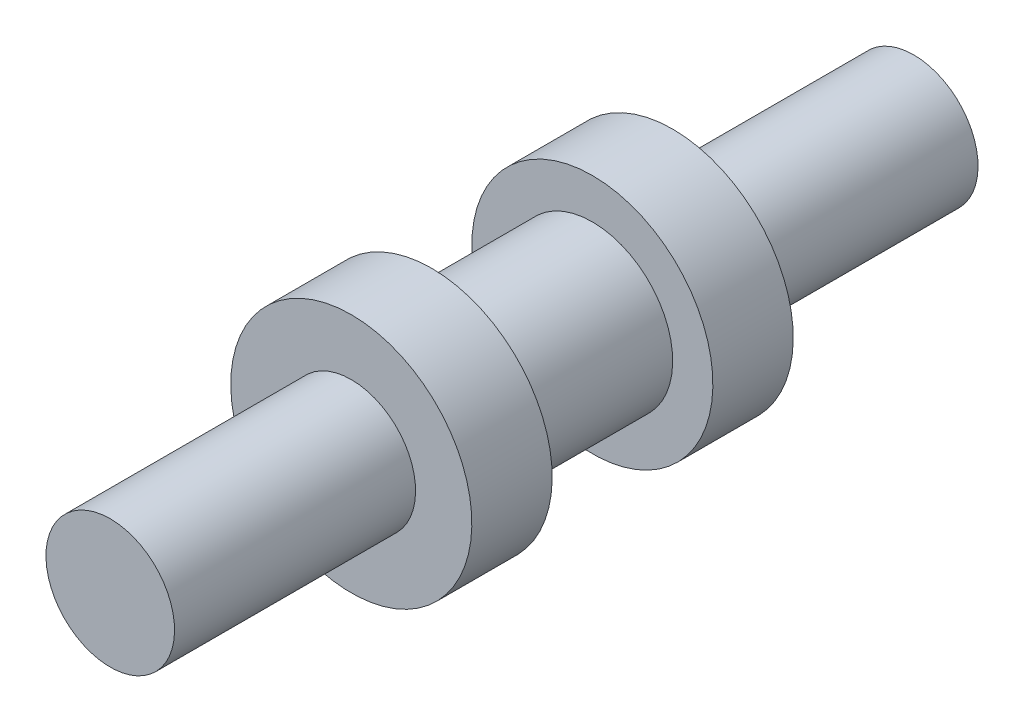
ISO-10303-21;
HEADER;
FILE_DESCRIPTION(('STEP AP214'),'2;1');
FILE_NAME('part.step','',(''),(''),'','','');
FILE_SCHEMA(('AUTOMOTIVE_DESIGN { 1 0 10303 214 1 1 1 1 }'));
ENDSEC;
DATA;
#1=APPLICATION_CONTEXT('core data for automotive mechanical design processes');
#2=APPLICATION_PROTOCOL_DEFINITION('international standard','automotive_design',2000,#1);
#3=PRODUCT_CONTEXT('',#1,'mechanical');
#4=PRODUCT('Part','Part','',(#3));
#5=PRODUCT_RELATED_PRODUCT_CATEGORY('part','',(#4));
#6=PRODUCT_DEFINITION_FORMATION('','',#4);
#7=PRODUCT_DEFINITION_CONTEXT('part definition',#1,'design');
#8=PRODUCT_DEFINITION('design','',#6,#7);
#9=PRODUCT_DEFINITION_SHAPE('','',#8);
#10=(LENGTH_UNIT() NAMED_UNIT(*) SI_UNIT(.MILLI.,.METRE.));
#11=(NAMED_UNIT(*) PLANE_ANGLE_UNIT() SI_UNIT($,.RADIAN.));
#12=(NAMED_UNIT(*) SI_UNIT($,.STERADIAN.) SOLID_ANGLE_UNIT());
#13=UNCERTAINTY_MEASURE_WITH_UNIT(LENGTH_MEASURE(1.E-05),#10,'distance_accuracy_value','');
#14=(GEOMETRIC_REPRESENTATION_CONTEXT(3) GLOBAL_UNCERTAINTY_ASSIGNED_CONTEXT((#13)) GLOBAL_UNIT_ASSIGNED_CONTEXT((#10,
#11,#12)) REPRESENTATION_CONTEXT('',''));
#15=CARTESIAN_POINT('',(0.,0.,0.));
#16=DIRECTION('',(0.,0.,1.));
#17=DIRECTION('',(1.,0.,0.));
#18=AXIS2_PLACEMENT_3D('',#15,#16,#17);
#19=CARTESIAN_POINT('',(0.,6.35,-6.35));
#20=DIRECTION('',(0.,0.,1.));
#21=DIRECTION('',(0.,-1.,0.));
#22=AXIS2_PLACEMENT_3D('',#19,#20,#21);
#23=PLANE('',#22);
#24=CARTESIAN_POINT('',(0.,0.,-6.35));
#25=DIRECTION('',(0.,0.,-1.));
#26=DIRECTION('',(0.,1.,0.));
#27=AXIS2_PLACEMENT_3D('',#24,#25,#26);
#28=CIRCLE('',#27,6.35);
#29=CARTESIAN_POINT('',(0.,6.35,-6.35));
#30=VERTEX_POINT('',#29);
#31=EDGE_CURVE('E10',#30,#30,#28,.T.);
#32=ORIENTED_EDGE('',*,*,#31,.T.);
#33=EDGE_LOOP('',(#32));
#34=FACE_BOUND('',#33,.T.);
#35=CARTESIAN_POINT('',(0.,0.,-6.35));
#36=DIRECTION('',(0.,0.,-1.));
#37=DIRECTION('',(0.,1.,0.));
#38=AXIS2_PLACEMENT_3D('',#35,#36,#37);
#39=CIRCLE('',#38,9.525);
#40=CARTESIAN_POINT('',(0.,9.525,-6.35));
#41=VERTEX_POINT('',#40);
#42=EDGE_CURVE('E63',#41,#41,#39,.T.);
#43=ORIENTED_EDGE('',*,*,#42,.F.);
#44=EDGE_LOOP('',(#43));
#45=FACE_BOUND('',#44,.T.);
#46=ADVANCED_FACE('F29',(#34,#45),#23,.T.);
#47=CARTESIAN_POINT('',(0.,0.,-31.75));
#48=DIRECTION('',(0.,0.,-1.));
#49=DIRECTION('',(0.,1.,0.));
#50=AXIS2_PLACEMENT_3D('',#47,#48,#49);
#51=CYLINDRICAL_SURFACE('',#50,6.35);
#52=CARTESIAN_POINT('',(0.,0.,6.35));
#53=DIRECTION('',(0.,0.,-1.));
#54=DIRECTION('',(0.,1.,0.));
#55=AXIS2_PLACEMENT_3D('',#52,#53,#54);
#56=CIRCLE('',#55,6.35);
#57=CARTESIAN_POINT('',(0.,6.35,6.35));
#58=VERTEX_POINT('',#57);
#59=EDGE_CURVE('E35',#58,#58,#56,.T.);
#60=ORIENTED_EDGE('',*,*,#59,.T.);
#61=EDGE_LOOP('',(#60));
#62=FACE_BOUND('',#61,.T.);
#63=ORIENTED_EDGE('',*,*,#31,.F.);
#64=EDGE_LOOP('',(#63));
#65=FACE_BOUND('',#64,.T.);
#66=ADVANCED_FACE('F71',(#62,#65),#51,.T.);
#67=CARTESIAN_POINT('',(0.,6.35,6.35));
#68=DIRECTION('',(0.,0.,-1.));
#69=DIRECTION('',(0.,1.,0.));
#70=AXIS2_PLACEMENT_3D('',#67,#68,#69);
#71=PLANE('',#70);
#72=CARTESIAN_POINT('',(0.,0.,6.35));
#73=DIRECTION('',(0.,0.,-1.));
#74=DIRECTION('',(0.,1.,0.));
#75=AXIS2_PLACEMENT_3D('',#72,#73,#74);
#76=CIRCLE('',#75,9.525);
#77=CARTESIAN_POINT('',(0.,9.525,6.35));
#78=VERTEX_POINT('',#77);
#79=EDGE_CURVE('E39',#78,#78,#76,.T.);
#80=ORIENTED_EDGE('',*,*,#79,.T.);
#81=EDGE_LOOP('',(#80));
#82=FACE_BOUND('',#81,.T.);
#83=ORIENTED_EDGE('',*,*,#59,.F.);
#84=EDGE_LOOP('',(#83));
#85=FACE_BOUND('',#84,.T.);
#86=ADVANCED_FACE('F75',(#82,#85),#71,.T.);
#87=CARTESIAN_POINT('',(0.,0.,-31.75));
#88=DIRECTION('',(0.,0.,-1.));
#89=DIRECTION('',(0.,1.,0.));
#90=AXIS2_PLACEMENT_3D('',#87,#88,#89);
#91=CYLINDRICAL_SURFACE('',#90,9.52500000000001);
#92=CARTESIAN_POINT('',(0.,0.,12.7));
#93=DIRECTION('',(0.,0.,-1.));
#94=DIRECTION('',(0.,1.,0.));
#95=AXIS2_PLACEMENT_3D('',#92,#93,#94);
#96=CIRCLE('',#95,9.52500000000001);
#97=CARTESIAN_POINT('',(0.,9.525,12.7));
#98=VERTEX_POINT('',#97);
#99=EDGE_CURVE('E43',#98,#98,#96,.T.);
#100=ORIENTED_EDGE('',*,*,#99,.T.);
#101=EDGE_LOOP('',(#100));
#102=FACE_BOUND('',#101,.T.);
#103=ORIENTED_EDGE('',*,*,#79,.F.);
#104=EDGE_LOOP('',(#103));
#105=FACE_BOUND('',#104,.T.);
#106=ADVANCED_FACE('F79',(#102,#105),#91,.T.);
#107=CARTESIAN_POINT('',(0.,9.525,12.7));
#108=DIRECTION('',(0.,0.,1.));
#109=DIRECTION('',(0.,-1.,0.));
#110=AXIS2_PLACEMENT_3D('',#107,#108,#109);
#111=PLANE('',#110);
#112=CARTESIAN_POINT('',(0.,0.,12.7));
#113=DIRECTION('',(0.,0.,-1.));
#114=DIRECTION('',(0.,1.,0.));
#115=AXIS2_PLACEMENT_3D('',#112,#113,#114);
#116=CIRCLE('',#115,5.08);
#117=CARTESIAN_POINT('',(0.,5.07999999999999,12.7));
#118=VERTEX_POINT('',#117);
#119=EDGE_CURVE('E48',#118,#118,#116,.T.);
#120=ORIENTED_EDGE('',*,*,#119,.T.);
#121=EDGE_LOOP('',(#120));
#122=FACE_BOUND('',#121,.T.);
#123=ORIENTED_EDGE('',*,*,#99,.F.);
#124=EDGE_LOOP('',(#123));
#125=FACE_BOUND('',#124,.T.);
#126=ADVANCED_FACE('F86',(#122,#125),#111,.T.);
#127=CARTESIAN_POINT('',(0.,0.,-31.75));
#128=DIRECTION('',(0.,0.,-1.));
#129=DIRECTION('',(0.,1.,0.));
#130=AXIS2_PLACEMENT_3D('',#127,#128,#129);
#131=CYLINDRICAL_SURFACE('',#130,5.08);
#132=CARTESIAN_POINT('',(0.,0.,31.75));
#133=DIRECTION('',(0.,0.,-1.));
#134=DIRECTION('',(0.,1.,0.));
#135=AXIS2_PLACEMENT_3D('',#132,#133,#134);
#136=CIRCLE('',#135,5.08);
#137=CARTESIAN_POINT('',(0.,5.07999999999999,31.75));
#138=VERTEX_POINT('',#137);
#139=EDGE_CURVE('E51',#138,#138,#136,.T.);
#140=ORIENTED_EDGE('',*,*,#139,.T.);
#141=EDGE_LOOP('',(#140));
#142=FACE_BOUND('',#141,.T.);
#143=ORIENTED_EDGE('',*,*,#119,.F.);
#144=EDGE_LOOP('',(#143));
#145=FACE_BOUND('',#144,.T.);
#146=ADVANCED_FACE('F90',(#142,#145),#131,.T.);
#147=CARTESIAN_POINT('',(0.,5.07999999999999,31.75));
#148=DIRECTION('',(0.,0.,1.));
#149=DIRECTION('',(0.,-1.,0.));
#150=AXIS2_PLACEMENT_3D('',#147,#148,#149);
#151=PLANE('',#150);
#152=ORIENTED_EDGE('',*,*,#139,.F.);
#153=EDGE_LOOP('',(#152));
#154=FACE_BOUND('',#153,.T.);
#155=ADVANCED_FACE('F94',(#154),#151,.T.);
#156=CARTESIAN_POINT('',(0.,5.07999999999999,-31.75));
#157=DIRECTION('',(0.,0.,-1.));
#158=DIRECTION('',(0.,1.,0.));
#159=AXIS2_PLACEMENT_3D('',#156,#157,#158);
#160=PLANE('',#159);
#161=CARTESIAN_POINT('',(0.,0.,-31.75));
#162=DIRECTION('',(0.,0.,-1.));
#163=DIRECTION('',(0.,1.,0.));
#164=AXIS2_PLACEMENT_3D('',#161,#162,#163);
#165=CIRCLE('',#164,5.08);
#166=CARTESIAN_POINT('',(0.,5.07999999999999,-31.75));
#167=VERTEX_POINT('',#166);
#168=EDGE_CURVE('E54',#167,#167,#165,.T.);
#169=ORIENTED_EDGE('',*,*,#168,.T.);
#170=EDGE_LOOP('',(#169));
#171=FACE_BOUND('',#170,.T.);
#172=ADVANCED_FACE('F98',(#171),#160,.T.);
#173=CARTESIAN_POINT('',(0.,0.,-31.75));
#174=DIRECTION('',(0.,0.,-1.));
#175=DIRECTION('',(0.,1.,0.));
#176=AXIS2_PLACEMENT_3D('',#173,#174,#175);
#177=CYLINDRICAL_SURFACE('',#176,5.08);
#178=CARTESIAN_POINT('',(0.,0.,-12.7));
#179=DIRECTION('',(0.,0.,-1.));
#180=DIRECTION('',(0.,1.,0.));
#181=AXIS2_PLACEMENT_3D('',#178,#179,#180);
#182=CIRCLE('',#181,5.08);
#183=CARTESIAN_POINT('',(0.,5.07999999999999,-12.7));
#184=VERTEX_POINT('',#183);
#185=EDGE_CURVE('E57',#184,#184,#182,.T.);
#186=ORIENTED_EDGE('',*,*,#185,.T.);
#187=EDGE_LOOP('',(#186));
#188=FACE_BOUND('',#187,.T.);
#189=ORIENTED_EDGE('',*,*,#168,.F.);
#190=EDGE_LOOP('',(#189));
#191=FACE_BOUND('',#190,.T.);
#192=ADVANCED_FACE('F102',(#188,#191),#177,.T.);
#193=CARTESIAN_POINT('',(0.,9.525,-12.7));
#194=DIRECTION('',(0.,0.,-1.));
#195=DIRECTION('',(0.,1.,0.));
#196=AXIS2_PLACEMENT_3D('',#193,#194,#195);
#197=PLANE('',#196);
#198=CARTESIAN_POINT('',(0.,0.,-12.7));
#199=DIRECTION('',(0.,0.,-1.));
#200=DIRECTION('',(0.,1.,0.));
#201=AXIS2_PLACEMENT_3D('',#198,#199,#200);
#202=CIRCLE('',#201,9.52500000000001);
#203=CARTESIAN_POINT('',(0.,9.525,-12.7));
#204=VERTEX_POINT('',#203);
#205=EDGE_CURVE('E60',#204,#204,#202,.T.);
#206=ORIENTED_EDGE('',*,*,#205,.T.);
#207=EDGE_LOOP('',(#206));
#208=FACE_BOUND('',#207,.T.);
#209=ORIENTED_EDGE('',*,*,#185,.F.);
#210=EDGE_LOOP('',(#209));
#211=FACE_BOUND('',#210,.T.);
#212=ADVANCED_FACE('F106',(#208,#211),#197,.T.);
#213=CARTESIAN_POINT('',(0.,0.,-31.75));
#214=DIRECTION('',(0.,0.,-1.));
#215=DIRECTION('',(0.,1.,0.));
#216=AXIS2_PLACEMENT_3D('',#213,#214,#215);
#217=CYLINDRICAL_SURFACE('',#216,9.52500000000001);
#218=ORIENTED_EDGE('',*,*,#42,.T.);
#219=EDGE_LOOP('',(#218));
#220=FACE_BOUND('',#219,.T.);
#221=ORIENTED_EDGE('',*,*,#205,.F.);
#222=EDGE_LOOP('',(#221));
#223=FACE_BOUND('',#222,.T.);
#224=ADVANCED_FACE('F67',(#220,#223),#217,.T.);
#225=CLOSED_SHELL('',(#46,#66,#86,#106,#126,#146,#155,#172,#192,#212,#224));
#226=MANIFOLD_SOLID_BREP('B2',#225);
#227=ADVANCED_BREP_SHAPE_REPRESENTATION('',(#18,#226),#14);
#228=SHAPE_DEFINITION_REPRESENTATION(#9,#227);
ENDSEC;
END-ISO-10303-21;
